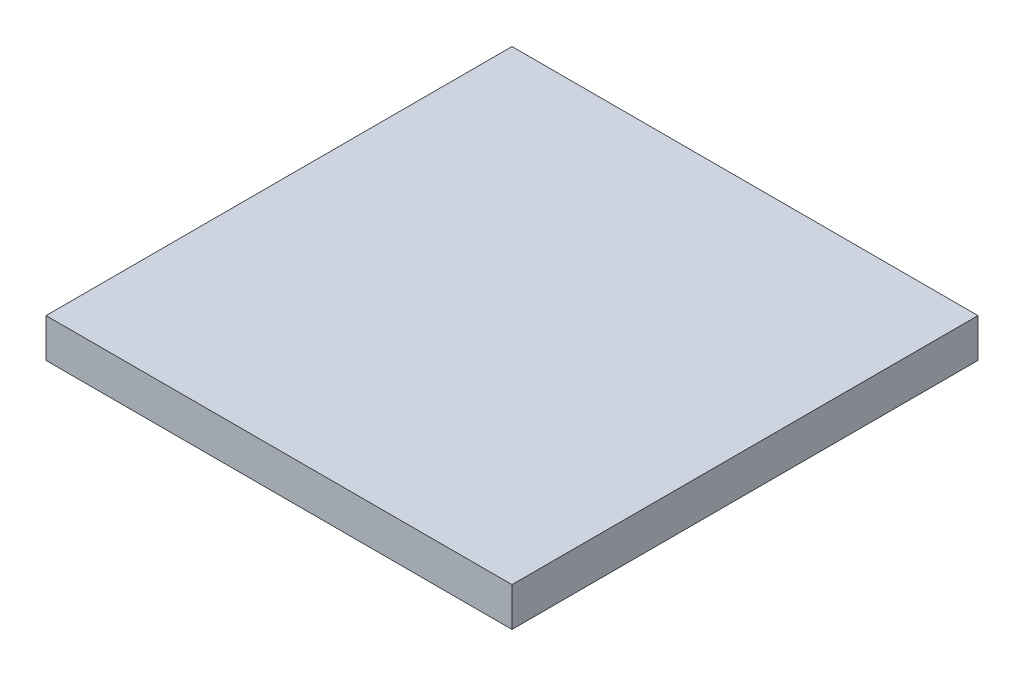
ISO-10303-21;
HEADER;
FILE_DESCRIPTION(('STEP AP214'),'2;1');
FILE_NAME('part.step','',(''),(''),'','','');
FILE_SCHEMA(('AUTOMOTIVE_DESIGN { 1 0 10303 214 1 1 1 1 }'));
ENDSEC;
DATA;
#1=APPLICATION_CONTEXT('core data for automotive mechanical design processes');
#2=APPLICATION_PROTOCOL_DEFINITION('international standard','automotive_design',2000,#1);
#3=PRODUCT_CONTEXT('',#1,'mechanical');
#4=PRODUCT('Part','Part','',(#3));
#5=PRODUCT_RELATED_PRODUCT_CATEGORY('part','',(#4));
#6=PRODUCT_DEFINITION_FORMATION('','',#4);
#7=PRODUCT_DEFINITION_CONTEXT('part definition',#1,'design');
#8=PRODUCT_DEFINITION('design','',#6,#7);
#9=PRODUCT_DEFINITION_SHAPE('','',#8);
#10=(LENGTH_UNIT() NAMED_UNIT(*) SI_UNIT(.MILLI.,.METRE.));
#11=(NAMED_UNIT(*) PLANE_ANGLE_UNIT() SI_UNIT($,.RADIAN.));
#12=(NAMED_UNIT(*) SI_UNIT($,.STERADIAN.) SOLID_ANGLE_UNIT());
#13=UNCERTAINTY_MEASURE_WITH_UNIT(LENGTH_MEASURE(1.E-05),#10,'distance_accuracy_value','');
#14=(GEOMETRIC_REPRESENTATION_CONTEXT(3) GLOBAL_UNCERTAINTY_ASSIGNED_CONTEXT((#13)) GLOBAL_UNIT_ASSIGNED_CONTEXT((#10,
#11,#12)) REPRESENTATION_CONTEXT('',''));
#15=CARTESIAN_POINT('',(0.,0.,0.));
#16=DIRECTION('',(0.,0.,1.));
#17=DIRECTION('',(1.,0.,0.));
#18=AXIS2_PLACEMENT_3D('',#15,#16,#17);
#19=CARTESIAN_POINT('',(0.,0.,-120.));
#20=DIRECTION('',(-1.,0.,0.));
#21=DIRECTION('',(0.,0.,1.));
#22=AXIS2_PLACEMENT_3D('',#19,#20,#21);
#23=PLANE('',#22);
#24=DIRECTION('',(0.,-1.,0.));
#25=VECTOR('',#24,1.);
#26=CARTESIAN_POINT('',(0.,0.,0.));
#27=LINE('',#26,#25);
#28=CARTESIAN_POINT('',(0.,10.,0.));
#29=VERTEX_POINT('',#28);
#30=CARTESIAN_POINT('',(0.,0.,0.));
#31=VERTEX_POINT('',#30);
#32=EDGE_CURVE('E66',#29,#31,#27,.T.);
#33=ORIENTED_EDGE('',*,*,#32,.F.);
#34=DIRECTION('',(0.,0.,1.));
#35=VECTOR('',#34,1.);
#36=CARTESIAN_POINT('',(0.,10.,-120.));
#37=LINE('',#36,#35);
#38=CARTESIAN_POINT('',(0.,10.,-120.));
#39=VERTEX_POINT('',#38);
#40=EDGE_CURVE('E11',#39,#29,#37,.T.);
#41=ORIENTED_EDGE('',*,*,#40,.F.);
#42=DIRECTION('',(0.,-1.,0.));
#43=VECTOR('',#42,1.);
#44=CARTESIAN_POINT('',(0.,0.,-120.));
#45=LINE('',#44,#43);
#46=CARTESIAN_POINT('',(0.,0.,-120.));
#47=VERTEX_POINT('',#46);
#48=EDGE_CURVE('E68',#39,#47,#45,.T.);
#49=ORIENTED_EDGE('',*,*,#48,.T.);
#50=DIRECTION('',(0.,0.,1.));
#51=VECTOR('',#50,1.);
#52=CARTESIAN_POINT('',(0.,0.,-120.));
#53=LINE('',#52,#51);
#54=EDGE_CURVE('E29',#47,#31,#53,.T.);
#55=ORIENTED_EDGE('',*,*,#54,.T.);
#56=EDGE_LOOP('',(#33,#41,#49,#55));
#57=FACE_BOUND('',#56,.T.);
#58=ADVANCED_FACE('F26',(#57),#23,.T.);
#59=CARTESIAN_POINT('',(0.,10.,-120.));
#60=DIRECTION('',(0.,1.,0.));
#61=DIRECTION('',(0.,0.,1.));
#62=AXIS2_PLACEMENT_3D('',#59,#60,#61);
#63=PLANE('',#62);
#64=DIRECTION('',(-1.,0.,0.));
#65=VECTOR('',#64,1.);
#66=CARTESIAN_POINT('',(0.,10.,0.));
#67=LINE('',#66,#65);
#68=CARTESIAN_POINT('',(120.,10.,0.));
#69=VERTEX_POINT('',#68);
#70=EDGE_CURVE('E83',#69,#29,#67,.T.);
#71=ORIENTED_EDGE('',*,*,#70,.F.);
#72=DIRECTION('',(0.,0.,1.));
#73=VECTOR('',#72,1.);
#74=CARTESIAN_POINT('',(120.,10.,-120.));
#75=LINE('',#74,#73);
#76=CARTESIAN_POINT('',(120.,10.,-120.));
#77=VERTEX_POINT('',#76);
#78=EDGE_CURVE('E34',#77,#69,#75,.T.);
#79=ORIENTED_EDGE('',*,*,#78,.F.);
#80=DIRECTION('',(-1.,0.,0.));
#81=VECTOR('',#80,1.);
#82=CARTESIAN_POINT('',(0.,10.,-120.));
#83=LINE('',#82,#81);
#84=EDGE_CURVE('E73',#77,#39,#83,.T.);
#85=ORIENTED_EDGE('',*,*,#84,.T.);
#86=ORIENTED_EDGE('',*,*,#40,.T.);
#87=EDGE_LOOP('',(#71,#79,#85,#86));
#88=FACE_BOUND('',#87,.T.);
#89=ADVANCED_FACE('F98',(#88),#63,.T.);
#90=CARTESIAN_POINT('',(120.,0.,-120.));
#91=DIRECTION('',(1.,0.,0.));
#92=DIRECTION('',(0.,0.,-1.));
#93=AXIS2_PLACEMENT_3D('',#90,#91,#92);
#94=PLANE('',#93);
#95=DIRECTION('',(0.,1.,0.));
#96=VECTOR('',#95,1.);
#97=CARTESIAN_POINT('',(120.,0.,0.));
#98=LINE('',#97,#96);
#99=CARTESIAN_POINT('',(120.,0.,0.));
#100=VERTEX_POINT('',#99);
#101=EDGE_CURVE('E80',#100,#69,#98,.T.);
#102=ORIENTED_EDGE('',*,*,#101,.F.);
#103=DIRECTION('',(0.,0.,1.));
#104=VECTOR('',#103,1.);
#105=CARTESIAN_POINT('',(120.,0.,-120.));
#106=LINE('',#105,#104);
#107=CARTESIAN_POINT('',(120.,0.,-120.));
#108=VERTEX_POINT('',#107);
#109=EDGE_CURVE('E72',#108,#100,#106,.T.);
#110=ORIENTED_EDGE('',*,*,#109,.F.);
#111=DIRECTION('',(0.,1.,0.));
#112=VECTOR('',#111,1.);
#113=CARTESIAN_POINT('',(120.,0.,-120.));
#114=LINE('',#113,#112);
#115=EDGE_CURVE('E91',#108,#77,#114,.T.);
#116=ORIENTED_EDGE('',*,*,#115,.T.);
#117=ORIENTED_EDGE('',*,*,#78,.T.);
#118=EDGE_LOOP('',(#102,#110,#116,#117));
#119=FACE_BOUND('',#118,.T.);
#120=ADVANCED_FACE('F95',(#119),#94,.T.);
#121=CARTESIAN_POINT('',(0.,0.,-120.));
#122=DIRECTION('',(0.,-1.,0.));
#123=DIRECTION('',(0.,0.,-1.));
#124=AXIS2_PLACEMENT_3D('',#121,#122,#123);
#125=PLANE('',#124);
#126=DIRECTION('',(1.,0.,0.));
#127=VECTOR('',#126,1.);
#128=CARTESIAN_POINT('',(0.,0.,0.));
#129=LINE('',#128,#127);
#130=EDGE_CURVE('E75',#31,#100,#129,.T.);
#131=ORIENTED_EDGE('',*,*,#130,.F.);
#132=ORIENTED_EDGE('',*,*,#54,.F.);
#133=DIRECTION('',(1.,0.,0.));
#134=VECTOR('',#133,1.);
#135=CARTESIAN_POINT('',(0.,0.,-120.));
#136=LINE('',#135,#134);
#137=EDGE_CURVE('E89',#47,#108,#136,.T.);
#138=ORIENTED_EDGE('',*,*,#137,.T.);
#139=ORIENTED_EDGE('',*,*,#109,.T.);
#140=EDGE_LOOP('',(#131,#132,#138,#139));
#141=FACE_BOUND('',#140,.T.);
#142=ADVANCED_FACE('F76',(#141),#125,.T.);
#143=CARTESIAN_POINT('',(0.,10.,-120.));
#144=DIRECTION('',(0.,0.,-1.));
#145=DIRECTION('',(-1.,0.,0.));
#146=AXIS2_PLACEMENT_3D('',#143,#144,#145);
#147=PLANE('',#146);
#148=ORIENTED_EDGE('',*,*,#48,.F.);
#149=ORIENTED_EDGE('',*,*,#84,.F.);
#150=ORIENTED_EDGE('',*,*,#115,.F.);
#151=ORIENTED_EDGE('',*,*,#137,.F.);
#152=EDGE_LOOP('',(#148,#149,#150,#151));
#153=FACE_BOUND('',#152,.T.);
#154=ADVANCED_FACE('F100',(#153),#147,.T.);
#155=CARTESIAN_POINT('',(0.,10.,0.));
#156=DIRECTION('',(0.,0.,-1.));
#157=DIRECTION('',(-1.,0.,0.));
#158=AXIS2_PLACEMENT_3D('',#155,#156,#157);
#159=PLANE('',#158);
#160=ORIENTED_EDGE('',*,*,#32,.T.);
#161=ORIENTED_EDGE('',*,*,#130,.T.);
#162=ORIENTED_EDGE('',*,*,#101,.T.);
#163=ORIENTED_EDGE('',*,*,#70,.T.);
#164=EDGE_LOOP('',(#160,#161,#162,#163));
#165=FACE_BOUND('',#164,.T.);
#166=ADVANCED_FACE('F82',(#165),#159,.F.);
#167=CLOSED_SHELL('',(#58,#89,#120,#142,#154,#166));
#168=MANIFOLD_SOLID_BREP('B2',#167);
#169=ADVANCED_BREP_SHAPE_REPRESENTATION('',(#18,#168),#14);
#170=SHAPE_DEFINITION_REPRESENTATION(#9,#169);
ENDSEC;
END-ISO-10303-21;
